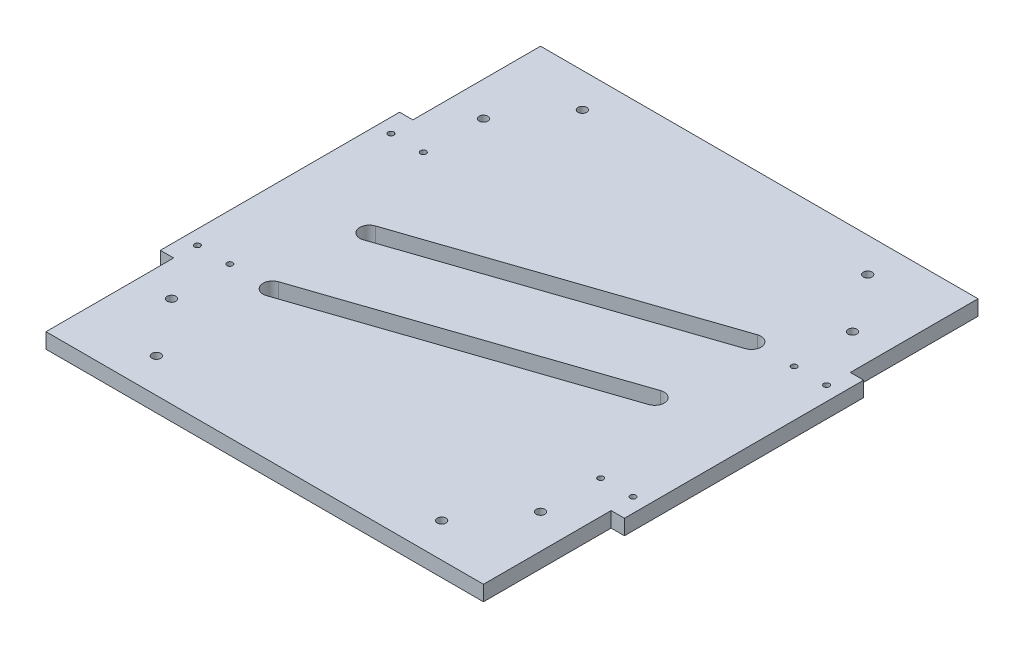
ISO-10303-21;
HEADER;
FILE_DESCRIPTION(('STEP AP214'),'2;1');
FILE_NAME('part.step','',(''),(''),'','','');
FILE_SCHEMA(('AUTOMOTIVE_DESIGN { 1 0 10303 214 1 1 1 1 }'));
ENDSEC;
DATA;
#1=APPLICATION_CONTEXT('core data for automotive mechanical design processes');
#2=APPLICATION_PROTOCOL_DEFINITION('international standard','automotive_design',2000,#1);
#3=PRODUCT_CONTEXT('',#1,'mechanical');
#4=PRODUCT('Part','Part','',(#3));
#5=PRODUCT_RELATED_PRODUCT_CATEGORY('part','',(#4));
#6=PRODUCT_DEFINITION_FORMATION('','',#4);
#7=PRODUCT_DEFINITION_CONTEXT('part definition',#1,'design');
#8=PRODUCT_DEFINITION('design','',#6,#7);
#9=PRODUCT_DEFINITION_SHAPE('','',#8);
#10=(LENGTH_UNIT() NAMED_UNIT(*) SI_UNIT(.MILLI.,.METRE.));
#11=(NAMED_UNIT(*) PLANE_ANGLE_UNIT() SI_UNIT($,.RADIAN.));
#12=(NAMED_UNIT(*) SI_UNIT($,.STERADIAN.) SOLID_ANGLE_UNIT());
#13=UNCERTAINTY_MEASURE_WITH_UNIT(LENGTH_MEASURE(1.E-05),#10,'distance_accuracy_value','');
#14=(GEOMETRIC_REPRESENTATION_CONTEXT(3) GLOBAL_UNCERTAINTY_ASSIGNED_CONTEXT((#13)) GLOBAL_UNIT_ASSIGNED_CONTEXT((#10,
#11,#12)) REPRESENTATION_CONTEXT('',''));
#15=CARTESIAN_POINT('',(0.,0.,0.));
#16=DIRECTION('',(0.,0.,1.));
#17=DIRECTION('',(1.,0.,0.));
#18=AXIS2_PLACEMENT_3D('',#15,#16,#17);
#19=CARTESIAN_POINT('',(0.,8.,0.));
#20=DIRECTION('',(0.,-1.,0.));
#21=DIRECTION('',(0.,0.,-1.));
#22=AXIS2_PLACEMENT_3D('',#19,#20,#21);
#23=PLANE('',#22);
#24=CARTESIAN_POINT('',(-75.,8.,0.));
#25=DIRECTION('',(0.,1.,0.));
#26=DIRECTION('',(0.,0.,1.));
#27=AXIS2_PLACEMENT_3D('',#24,#25,#26);
#28=CIRCLE('',#27,5.);
#29=CARTESIAN_POINT('',(-76.6059762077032,8.,-4.73506498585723));
#30=VERTEX_POINT('',#29);
#31=CARTESIAN_POINT('',(-73.3940237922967,8.,4.73506498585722));
#32=VERTEX_POINT('',#31);
#33=EDGE_CURVE('E212',#30,#32,#28,.T.);
#34=ORIENTED_EDGE('',*,*,#33,.F.);
#35=DIRECTION('',(-0.947012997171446,0.,0.321195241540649));
#36=VECTOR('',#35,1.);
#37=CARTESIAN_POINT('',(-76.6059762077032,8.,-4.73506498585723));
#38=LINE('',#37,#36);
#39=CARTESIAN_POINT('',(73.3940237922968,8.,-55.6100649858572));
#40=VERTEX_POINT('',#39);
#41=EDGE_CURVE('E220',#40,#30,#38,.T.);
#42=ORIENTED_EDGE('',*,*,#41,.F.);
#43=CARTESIAN_POINT('',(75.,8.,-50.875));
#44=DIRECTION('',(0.,1.,0.));
#45=DIRECTION('',(0.,0.,1.));
#46=AXIS2_PLACEMENT_3D('',#43,#44,#45);
#47=CIRCLE('',#46,5.00000000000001);
#48=CARTESIAN_POINT('',(76.6059762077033,8.,-46.1399350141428));
#49=VERTEX_POINT('',#48);
#50=EDGE_CURVE('E217',#49,#40,#47,.T.);
#51=ORIENTED_EDGE('',*,*,#50,.F.);
#52=DIRECTION('',(0.947012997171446,0.,-0.321195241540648));
#53=VECTOR('',#52,1.);
#54=CARTESIAN_POINT('',(-73.3940237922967,8.,4.73506498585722));
#55=LINE('',#54,#53);
#56=EDGE_CURVE('E214',#32,#49,#55,.T.);
#57=ORIENTED_EDGE('',*,*,#56,.F.);
#58=EDGE_LOOP('',(#34,#42,#51,#57));
#59=FACE_BOUND('',#58,.T.);
#60=DIRECTION('',(0.,0.,1.));
#61=VECTOR('',#60,1.);
#62=CARTESIAN_POINT('',(-115.,8.,-62.88));
#63=LINE('',#62,#61);
#64=CARTESIAN_POINT('',(-115.,8.,-130.));
#65=VERTEX_POINT('',#64);
#66=CARTESIAN_POINT('',(-115.,8.,-62.88));
#67=VERTEX_POINT('',#66);
#68=EDGE_CURVE('E339',#65,#67,#63,.T.);
#69=ORIENTED_EDGE('',*,*,#68,.T.);
#70=DIRECTION('',(-1.,0.,0.));
#71=VECTOR('',#70,1.);
#72=CARTESIAN_POINT('',(-122.,8.,-62.88));
#73=LINE('',#72,#71);
#74=CARTESIAN_POINT('',(-122.,8.,-62.88));
#75=VERTEX_POINT('',#74);
#76=EDGE_CURVE('E342',#67,#75,#73,.T.);
#77=ORIENTED_EDGE('',*,*,#76,.T.);
#78=DIRECTION('',(0.,0.,1.));
#79=VECTOR('',#78,1.);
#80=CARTESIAN_POINT('',(-122.,8.,62.88));
#81=LINE('',#80,#79);
#82=CARTESIAN_POINT('',(-122.,8.,62.88));
#83=VERTEX_POINT('',#82);
#84=EDGE_CURVE('E345',#75,#83,#81,.T.);
#85=ORIENTED_EDGE('',*,*,#84,.T.);
#86=DIRECTION('',(1.,0.,0.));
#87=VECTOR('',#86,1.);
#88=CARTESIAN_POINT('',(-115.,8.,62.88));
#89=LINE('',#88,#87);
#90=CARTESIAN_POINT('',(-115.,8.,62.88));
#91=VERTEX_POINT('',#90);
#92=EDGE_CURVE('E347',#83,#91,#89,.T.);
#93=ORIENTED_EDGE('',*,*,#92,.T.);
#94=DIRECTION('',(0.,0.,1.));
#95=VECTOR('',#94,1.);
#96=CARTESIAN_POINT('',(-115.,8.,130.));
#97=LINE('',#96,#95);
#98=CARTESIAN_POINT('',(-115.,8.,130.));
#99=VERTEX_POINT('',#98);
#100=EDGE_CURVE('E349',#91,#99,#97,.T.);
#101=ORIENTED_EDGE('',*,*,#100,.T.);
#102=DIRECTION('',(1.,0.,0.));
#103=VECTOR('',#102,1.);
#104=CARTESIAN_POINT('',(115.,8.,130.));
#105=LINE('',#104,#103);
#106=CARTESIAN_POINT('',(115.,8.,130.));
#107=VERTEX_POINT('',#106);
#108=EDGE_CURVE('E351',#99,#107,#105,.T.);
#109=ORIENTED_EDGE('',*,*,#108,.T.);
#110=DIRECTION('',(0.,0.,-1.));
#111=VECTOR('',#110,1.);
#112=CARTESIAN_POINT('',(115.,8.,62.88));
#113=LINE('',#112,#111);
#114=CARTESIAN_POINT('',(115.,8.,62.88));
#115=VERTEX_POINT('',#114);
#116=EDGE_CURVE('E353',#107,#115,#113,.T.);
#117=ORIENTED_EDGE('',*,*,#116,.T.);
#118=DIRECTION('',(1.,0.,0.));
#119=VECTOR('',#118,1.);
#120=CARTESIAN_POINT('',(122.,8.,62.88));
#121=LINE('',#120,#119);
#122=CARTESIAN_POINT('',(122.,8.,62.88));
#123=VERTEX_POINT('',#122);
#124=EDGE_CURVE('E355',#115,#123,#121,.T.);
#125=ORIENTED_EDGE('',*,*,#124,.T.);
#126=DIRECTION('',(0.,0.,-1.));
#127=VECTOR('',#126,1.);
#128=CARTESIAN_POINT('',(122.,8.,-62.88));
#129=LINE('',#128,#127);
#130=CARTESIAN_POINT('',(122.,8.,-62.88));
#131=VERTEX_POINT('',#130);
#132=EDGE_CURVE('E357',#123,#131,#129,.T.);
#133=ORIENTED_EDGE('',*,*,#132,.T.);
#134=DIRECTION('',(-1.,0.,0.));
#135=VECTOR('',#134,1.);
#136=CARTESIAN_POINT('',(115.,8.,-62.88));
#137=LINE('',#136,#135);
#138=CARTESIAN_POINT('',(115.,8.,-62.88));
#139=VERTEX_POINT('',#138);
#140=EDGE_CURVE('E359',#131,#139,#137,.T.);
#141=ORIENTED_EDGE('',*,*,#140,.T.);
#142=DIRECTION('',(0.,0.,-1.));
#143=VECTOR('',#142,1.);
#144=CARTESIAN_POINT('',(115.,8.,-130.));
#145=LINE('',#144,#143);
#146=CARTESIAN_POINT('',(115.,8.,-130.));
#147=VERTEX_POINT('',#146);
#148=EDGE_CURVE('E361',#139,#147,#145,.T.);
#149=ORIENTED_EDGE('',*,*,#148,.T.);
#150=DIRECTION('',(-1.,0.,0.));
#151=VECTOR('',#150,1.);
#152=CARTESIAN_POINT('',(-115.,8.,-130.));
#153=LINE('',#152,#151);
#154=EDGE_CURVE('E363',#147,#65,#153,.T.);
#155=ORIENTED_EDGE('',*,*,#154,.T.);
#156=EDGE_LOOP('',(#69,#77,#85,#93,#101,#109,#117,#125,#133,#141,#149,#155));
#157=FACE_BOUND('',#156,.T.);
#158=CARTESIAN_POINT('',(-75.,8.,112.));
#159=DIRECTION('',(0.,1.,0.));
#160=DIRECTION('',(0.,0.,1.));
#161=AXIS2_PLACEMENT_3D('',#158,#159,#160);
#162=CIRCLE('',#161,2.28499999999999);
#163=CARTESIAN_POINT('',(-75.,8.,114.285));
#164=VERTEX_POINT('',#163);
#165=EDGE_CURVE('E333',#164,#164,#162,.T.);
#166=ORIENTED_EDGE('',*,*,#165,.F.);
#167=EDGE_LOOP('',(#166));
#168=FACE_BOUND('',#167,.T.);
#169=CARTESIAN_POINT('',(-97.,8.,82.));
#170=DIRECTION('',(0.,1.,0.));
#171=DIRECTION('',(0.,0.,1.));
#172=AXIS2_PLACEMENT_3D('',#169,#170,#171);
#173=CIRCLE('',#172,2.28499999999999);
#174=CARTESIAN_POINT('',(-97.,8.,84.285));
#175=VERTEX_POINT('',#174);
#176=EDGE_CURVE('E327',#175,#175,#173,.T.);
#177=ORIENTED_EDGE('',*,*,#176,.F.);
#178=EDGE_LOOP('',(#177));
#179=FACE_BOUND('',#178,.T.);
#180=CARTESIAN_POINT('',(97.,8.,82.));
#181=DIRECTION('',(0.,1.,0.));
#182=DIRECTION('',(0.,0.,-1.));
#183=AXIS2_PLACEMENT_3D('',#180,#181,#182);
#184=CIRCLE('',#183,2.28499999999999);
#185=CARTESIAN_POINT('',(97.,8.,79.715));
#186=VERTEX_POINT('',#185);
#187=EDGE_CURVE('E321',#186,#186,#184,.T.);
#188=ORIENTED_EDGE('',*,*,#187,.F.);
#189=EDGE_LOOP('',(#188));
#190=FACE_BOUND('',#189,.T.);
#191=CARTESIAN_POINT('',(75.,8.,112.));
#192=DIRECTION('',(0.,1.,0.));
#193=DIRECTION('',(0.,0.,-1.));
#194=AXIS2_PLACEMENT_3D('',#191,#192,#193);
#195=CIRCLE('',#194,2.28499999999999);
#196=CARTESIAN_POINT('',(75.,8.,109.715));
#197=VERTEX_POINT('',#196);
#198=EDGE_CURVE('E315',#197,#197,#195,.T.);
#199=ORIENTED_EDGE('',*,*,#198,.F.);
#200=EDGE_LOOP('',(#199));
#201=FACE_BOUND('',#200,.T.);
#202=CARTESIAN_POINT('',(75.,8.,-112.));
#203=DIRECTION('',(0.,1.,0.));
#204=DIRECTION('',(0.,0.,1.));
#205=AXIS2_PLACEMENT_3D('',#202,#203,#204);
#206=CIRCLE('',#205,2.28499999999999);
#207=CARTESIAN_POINT('',(75.,8.,-109.715));
#208=VERTEX_POINT('',#207);
#209=EDGE_CURVE('E309',#208,#208,#206,.T.);
#210=ORIENTED_EDGE('',*,*,#209,.F.);
#211=EDGE_LOOP('',(#210));
#212=FACE_BOUND('',#211,.T.);
#213=CARTESIAN_POINT('',(97.,8.,-82.));
#214=DIRECTION('',(0.,1.,0.));
#215=DIRECTION('',(0.,0.,1.));
#216=AXIS2_PLACEMENT_3D('',#213,#214,#215);
#217=CIRCLE('',#216,2.28499999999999);
#218=CARTESIAN_POINT('',(97.,8.,-79.715));
#219=VERTEX_POINT('',#218);
#220=EDGE_CURVE('E303',#219,#219,#217,.T.);
#221=ORIENTED_EDGE('',*,*,#220,.F.);
#222=EDGE_LOOP('',(#221));
#223=FACE_BOUND('',#222,.T.);
#224=CARTESIAN_POINT('',(-97.,8.,-82.));
#225=DIRECTION('',(0.,1.,0.));
#226=DIRECTION('',(0.,0.,-1.));
#227=AXIS2_PLACEMENT_3D('',#224,#225,#226);
#228=CIRCLE('',#227,2.28499999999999);
#229=CARTESIAN_POINT('',(-97.,8.,-84.285));
#230=VERTEX_POINT('',#229);
#231=EDGE_CURVE('E297',#230,#230,#228,.T.);
#232=ORIENTED_EDGE('',*,*,#231,.F.);
#233=EDGE_LOOP('',(#232));
#234=FACE_BOUND('',#233,.T.);
#235=CARTESIAN_POINT('',(-75.,8.,-112.));
#236=DIRECTION('',(0.,1.,0.));
#237=DIRECTION('',(0.,0.,-1.));
#238=AXIS2_PLACEMENT_3D('',#235,#236,#237);
#239=CIRCLE('',#238,2.28499999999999);
#240=CARTESIAN_POINT('',(-75.,8.,-114.285));
#241=VERTEX_POINT('',#240);
#242=EDGE_CURVE('E291',#241,#241,#239,.T.);
#243=ORIENTED_EDGE('',*,*,#242,.F.);
#244=EDGE_LOOP('',(#243));
#245=FACE_BOUND('',#244,.T.);
#246=CARTESIAN_POINT('',(-97.5,8.,-50.875));
#247=DIRECTION('',(0.,1.,0.));
#248=DIRECTION('',(0.,0.,1.));
#249=AXIS2_PLACEMENT_3D('',#246,#247,#248);
#250=CIRCLE('',#249,1.5);
#251=CARTESIAN_POINT('',(-97.5,8.,-49.375));
#252=VERTEX_POINT('',#251);
#253=EDGE_CURVE('E285',#252,#252,#250,.T.);
#254=ORIENTED_EDGE('',*,*,#253,.F.);
#255=EDGE_LOOP('',(#254));
#256=FACE_BOUND('',#255,.T.);
#257=CARTESIAN_POINT('',(-114.5,8.,50.875));
#258=DIRECTION('',(0.,1.,0.));
#259=DIRECTION('',(0.,0.,1.));
#260=AXIS2_PLACEMENT_3D('',#257,#258,#259);
#261=CIRCLE('',#260,1.5);
#262=CARTESIAN_POINT('',(-114.5,8.,52.375));
#263=VERTEX_POINT('',#262);
#264=EDGE_CURVE('E279',#263,#263,#261,.T.);
#265=ORIENTED_EDGE('',*,*,#264,.F.);
#266=EDGE_LOOP('',(#265));
#267=FACE_BOUND('',#266,.T.);
#268=CARTESIAN_POINT('',(-114.5,8.,-50.875));
#269=DIRECTION('',(0.,1.,0.));
#270=DIRECTION('',(0.,0.,1.));
#271=AXIS2_PLACEMENT_3D('',#268,#269,#270);
#272=CIRCLE('',#271,1.5);
#273=CARTESIAN_POINT('',(-114.5,8.,-49.375));
#274=VERTEX_POINT('',#273);
#275=EDGE_CURVE('E273',#274,#274,#272,.T.);
#276=ORIENTED_EDGE('',*,*,#275,.F.);
#277=EDGE_LOOP('',(#276));
#278=FACE_BOUND('',#277,.T.);
#279=CARTESIAN_POINT('',(-97.5,8.,50.875));
#280=DIRECTION('',(0.,1.,0.));
#281=DIRECTION('',(0.,0.,1.));
#282=AXIS2_PLACEMENT_3D('',#279,#280,#281);
#283=CIRCLE('',#282,1.5);
#284=CARTESIAN_POINT('',(-97.5,8.,52.375));
#285=VERTEX_POINT('',#284);
#286=EDGE_CURVE('E267',#285,#285,#283,.T.);
#287=ORIENTED_EDGE('',*,*,#286,.F.);
#288=EDGE_LOOP('',(#287));
#289=FACE_BOUND('',#288,.T.);
#290=CARTESIAN_POINT('',(97.5,8.,50.875));
#291=DIRECTION('',(0.,1.,0.));
#292=DIRECTION('',(0.,0.,-1.));
#293=AXIS2_PLACEMENT_3D('',#290,#291,#292);
#294=CIRCLE('',#293,1.5);
#295=CARTESIAN_POINT('',(97.5,8.,49.375));
#296=VERTEX_POINT('',#295);
#297=EDGE_CURVE('E261',#296,#296,#294,.T.);
#298=ORIENTED_EDGE('',*,*,#297,.F.);
#299=EDGE_LOOP('',(#298));
#300=FACE_BOUND('',#299,.T.);
#301=CARTESIAN_POINT('',(114.5,8.,50.875));
#302=DIRECTION('',(0.,1.,0.));
#303=DIRECTION('',(0.,0.,-1.));
#304=AXIS2_PLACEMENT_3D('',#301,#302,#303);
#305=CIRCLE('',#304,1.5);
#306=CARTESIAN_POINT('',(114.5,8.,49.375));
#307=VERTEX_POINT('',#306);
#308=EDGE_CURVE('E255',#307,#307,#305,.T.);
#309=ORIENTED_EDGE('',*,*,#308,.F.);
#310=EDGE_LOOP('',(#309));
#311=FACE_BOUND('',#310,.T.);
#312=CARTESIAN_POINT('',(97.5,8.,-50.875));
#313=DIRECTION('',(0.,1.,0.));
#314=DIRECTION('',(0.,0.,-1.));
#315=AXIS2_PLACEMENT_3D('',#312,#313,#314);
#316=CIRCLE('',#315,1.5);
#317=CARTESIAN_POINT('',(97.5,8.,-52.375));
#318=VERTEX_POINT('',#317);
#319=EDGE_CURVE('E249',#318,#318,#316,.T.);
#320=ORIENTED_EDGE('',*,*,#319,.F.);
#321=EDGE_LOOP('',(#320));
#322=FACE_BOUND('',#321,.T.);
#323=CARTESIAN_POINT('',(114.5,8.,-50.875));
#324=DIRECTION('',(0.,1.,0.));
#325=DIRECTION('',(0.,0.,-1.));
#326=AXIS2_PLACEMENT_3D('',#323,#324,#325);
#327=CIRCLE('',#326,1.5);
#328=CARTESIAN_POINT('',(114.5,8.,-52.375));
#329=VERTEX_POINT('',#328);
#330=EDGE_CURVE('E243',#329,#329,#327,.T.);
#331=ORIENTED_EDGE('',*,*,#330,.F.);
#332=EDGE_LOOP('',(#331));
#333=FACE_BOUND('',#332,.T.);
#334=CARTESIAN_POINT('',(-75.,8.,50.875));
#335=DIRECTION('',(0.,1.,0.));
#336=DIRECTION('',(0.,0.,1.));
#337=AXIS2_PLACEMENT_3D('',#334,#335,#336);
#338=CIRCLE('',#337,4.99999999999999);
#339=CARTESIAN_POINT('',(-76.6059762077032,8.,46.1399350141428));
#340=VERTEX_POINT('',#339);
#341=CARTESIAN_POINT('',(-73.3940237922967,8.,55.6100649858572));
#342=VERTEX_POINT('',#341);
#343=EDGE_CURVE('E176',#340,#342,#338,.T.);
#344=ORIENTED_EDGE('',*,*,#343,.F.);
#345=DIRECTION('',(-0.947012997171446,0.,0.321195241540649));
#346=VECTOR('',#345,1.);
#347=CARTESIAN_POINT('',(-76.6059762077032,8.,46.1399350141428));
#348=LINE('',#347,#346);
#349=CARTESIAN_POINT('',(73.3940237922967,8.,-4.73506498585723));
#350=VERTEX_POINT('',#349);
#351=EDGE_CURVE('E198',#350,#340,#348,.T.);
#352=ORIENTED_EDGE('',*,*,#351,.F.);
#353=CARTESIAN_POINT('',(75.,8.,0.));
#354=DIRECTION('',(0.,1.,0.));
#355=DIRECTION('',(0.,0.,1.));
#356=AXIS2_PLACEMENT_3D('',#353,#354,#355);
#357=CIRCLE('',#356,5.);
#358=CARTESIAN_POINT('',(76.6059762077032,8.,4.73506498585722));
#359=VERTEX_POINT('',#358);
#360=EDGE_CURVE('E196',#359,#350,#357,.T.);
#361=ORIENTED_EDGE('',*,*,#360,.F.);
#362=DIRECTION('',(0.947012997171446,0.,-0.321195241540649));
#363=VECTOR('',#362,1.);
#364=CARTESIAN_POINT('',(-73.3940237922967,8.,55.6100649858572));
#365=LINE('',#364,#363);
#366=EDGE_CURVE('E184',#342,#359,#365,.T.);
#367=ORIENTED_EDGE('',*,*,#366,.F.);
#368=EDGE_LOOP('',(#344,#352,#361,#367));
#369=FACE_BOUND('',#368,.T.);
#370=ADVANCED_FACE('F39',(#59,#157,#168,#179,#190,#201,#212,#223,#234,#245,#256,#267,#278,#289,
#300,#311,#322,#333,#369),#23,.F.);
#371=CARTESIAN_POINT('',(0.,0.,0.));
#372=DIRECTION('',(0.,-1.,0.));
#373=DIRECTION('',(0.,0.,-1.));
#374=AXIS2_PLACEMENT_3D('',#371,#372,#373);
#375=PLANE('',#374);
#376=CARTESIAN_POINT('',(97.5,0.,-50.875));
#377=DIRECTION('',(0.,1.,0.));
#378=DIRECTION('',(0.,0.,-1.));
#379=AXIS2_PLACEMENT_3D('',#376,#377,#378);
#380=CIRCLE('',#379,1.5);
#381=CARTESIAN_POINT('',(97.5,0.,-52.375));
#382=VERTEX_POINT('',#381);
#383=EDGE_CURVE('E246',#382,#382,#380,.T.);
#384=ORIENTED_EDGE('',*,*,#383,.T.);
#385=EDGE_LOOP('',(#384));
#386=FACE_BOUND('',#385,.T.);
#387=CARTESIAN_POINT('',(97.5,0.,50.875));
#388=DIRECTION('',(0.,1.,0.));
#389=DIRECTION('',(0.,0.,-1.));
#390=AXIS2_PLACEMENT_3D('',#387,#388,#389);
#391=CIRCLE('',#390,1.5);
#392=CARTESIAN_POINT('',(97.5,0.,49.375));
#393=VERTEX_POINT('',#392);
#394=EDGE_CURVE('E258',#393,#393,#391,.T.);
#395=ORIENTED_EDGE('',*,*,#394,.T.);
#396=EDGE_LOOP('',(#395));
#397=FACE_BOUND('',#396,.T.);
#398=CARTESIAN_POINT('',(-114.5,0.,-50.875));
#399=DIRECTION('',(0.,1.,0.));
#400=DIRECTION('',(0.,0.,1.));
#401=AXIS2_PLACEMENT_3D('',#398,#399,#400);
#402=CIRCLE('',#401,1.5);
#403=CARTESIAN_POINT('',(-114.5,0.,-49.375));
#404=VERTEX_POINT('',#403);
#405=EDGE_CURVE('E270',#404,#404,#402,.T.);
#406=ORIENTED_EDGE('',*,*,#405,.T.);
#407=EDGE_LOOP('',(#406));
#408=FACE_BOUND('',#407,.T.);
#409=CARTESIAN_POINT('',(-97.5,0.,-50.875));
#410=DIRECTION('',(0.,1.,0.));
#411=DIRECTION('',(0.,0.,1.));
#412=AXIS2_PLACEMENT_3D('',#409,#410,#411);
#413=CIRCLE('',#412,1.5);
#414=CARTESIAN_POINT('',(-97.5,0.,-49.375));
#415=VERTEX_POINT('',#414);
#416=EDGE_CURVE('E282',#415,#415,#413,.T.);
#417=ORIENTED_EDGE('',*,*,#416,.T.);
#418=EDGE_LOOP('',(#417));
#419=FACE_BOUND('',#418,.T.);
#420=CARTESIAN_POINT('',(-97.,0.,-82.));
#421=DIRECTION('',(0.,1.,0.));
#422=DIRECTION('',(0.,0.,-1.));
#423=AXIS2_PLACEMENT_3D('',#420,#421,#422);
#424=CIRCLE('',#423,2.28499999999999);
#425=CARTESIAN_POINT('',(-97.,0.,-84.285));
#426=VERTEX_POINT('',#425);
#427=EDGE_CURVE('E294',#426,#426,#424,.T.);
#428=ORIENTED_EDGE('',*,*,#427,.T.);
#429=EDGE_LOOP('',(#428));
#430=FACE_BOUND('',#429,.T.);
#431=CARTESIAN_POINT('',(75.,0.,-112.));
#432=DIRECTION('',(0.,1.,0.));
#433=DIRECTION('',(0.,0.,1.));
#434=AXIS2_PLACEMENT_3D('',#431,#432,#433);
#435=CIRCLE('',#434,2.28499999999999);
#436=CARTESIAN_POINT('',(75.,0.,-109.715));
#437=VERTEX_POINT('',#436);
#438=EDGE_CURVE('E306',#437,#437,#435,.T.);
#439=ORIENTED_EDGE('',*,*,#438,.T.);
#440=EDGE_LOOP('',(#439));
#441=FACE_BOUND('',#440,.T.);
#442=CARTESIAN_POINT('',(97.,0.,82.));
#443=DIRECTION('',(0.,1.,0.));
#444=DIRECTION('',(0.,0.,-1.));
#445=AXIS2_PLACEMENT_3D('',#442,#443,#444);
#446=CIRCLE('',#445,2.28499999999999);
#447=CARTESIAN_POINT('',(97.,0.,79.715));
#448=VERTEX_POINT('',#447);
#449=EDGE_CURVE('E318',#448,#448,#446,.T.);
#450=ORIENTED_EDGE('',*,*,#449,.T.);
#451=EDGE_LOOP('',(#450));
#452=FACE_BOUND('',#451,.T.);
#453=CARTESIAN_POINT('',(-75.,0.,112.));
#454=DIRECTION('',(0.,1.,0.));
#455=DIRECTION('',(0.,0.,1.));
#456=AXIS2_PLACEMENT_3D('',#453,#454,#455);
#457=CIRCLE('',#456,2.28499999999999);
#458=CARTESIAN_POINT('',(-75.,0.,114.285));
#459=VERTEX_POINT('',#458);
#460=EDGE_CURVE('E330',#459,#459,#457,.T.);
#461=ORIENTED_EDGE('',*,*,#460,.T.);
#462=EDGE_LOOP('',(#461));
#463=FACE_BOUND('',#462,.T.);
#464=DIRECTION('',(0.,0.,1.));
#465=VECTOR('',#464,1.);
#466=CARTESIAN_POINT('',(-115.,0.,-62.88));
#467=LINE('',#466,#465);
#468=CARTESIAN_POINT('',(-115.,0.,-130.));
#469=VERTEX_POINT('',#468);
#470=CARTESIAN_POINT('',(-115.,0.,-62.88));
#471=VERTEX_POINT('',#470);
#472=EDGE_CURVE('E336',#469,#471,#467,.T.);
#473=ORIENTED_EDGE('',*,*,#472,.F.);
#474=DIRECTION('',(-1.,0.,0.));
#475=VECTOR('',#474,1.);
#476=CARTESIAN_POINT('',(-115.,0.,-130.));
#477=LINE('',#476,#475);
#478=CARTESIAN_POINT('',(115.,0.,-130.));
#479=VERTEX_POINT('',#478);
#480=EDGE_CURVE('E343',#479,#469,#477,.T.);
#481=ORIENTED_EDGE('',*,*,#480,.F.);
#482=DIRECTION('',(0.,0.,-1.));
#483=VECTOR('',#482,1.);
#484=CARTESIAN_POINT('',(115.,0.,-130.));
#485=LINE('',#484,#483);
#486=CARTESIAN_POINT('',(115.,0.,-62.88));
#487=VERTEX_POINT('',#486);
#488=EDGE_CURVE('E386',#487,#479,#485,.T.);
#489=ORIENTED_EDGE('',*,*,#488,.F.);
#490=DIRECTION('',(-1.,0.,0.));
#491=VECTOR('',#490,1.);
#492=CARTESIAN_POINT('',(115.,0.,-62.88));
#493=LINE('',#492,#491);
#494=CARTESIAN_POINT('',(122.,0.,-62.88));
#495=VERTEX_POINT('',#494);
#496=EDGE_CURVE('E384',#495,#487,#493,.T.);
#497=ORIENTED_EDGE('',*,*,#496,.F.);
#498=DIRECTION('',(0.,0.,-1.));
#499=VECTOR('',#498,1.);
#500=CARTESIAN_POINT('',(122.,0.,-62.88));
#501=LINE('',#500,#499);
#502=CARTESIAN_POINT('',(122.,0.,62.88));
#503=VERTEX_POINT('',#502);
#504=EDGE_CURVE('E382',#503,#495,#501,.T.);
#505=ORIENTED_EDGE('',*,*,#504,.F.);
#506=DIRECTION('',(1.,0.,0.));
#507=VECTOR('',#506,1.);
#508=CARTESIAN_POINT('',(122.,0.,62.88));
#509=LINE('',#508,#507);
#510=CARTESIAN_POINT('',(115.,0.,62.88));
#511=VERTEX_POINT('',#510);
#512=EDGE_CURVE('E380',#511,#503,#509,.T.);
#513=ORIENTED_EDGE('',*,*,#512,.F.);
#514=DIRECTION('',(0.,0.,-1.));
#515=VECTOR('',#514,1.);
#516=CARTESIAN_POINT('',(115.,0.,62.88));
#517=LINE('',#516,#515);
#518=CARTESIAN_POINT('',(115.,0.,130.));
#519=VERTEX_POINT('',#518);
#520=EDGE_CURVE('E378',#519,#511,#517,.T.);
#521=ORIENTED_EDGE('',*,*,#520,.F.);
#522=DIRECTION('',(1.,0.,0.));
#523=VECTOR('',#522,1.);
#524=CARTESIAN_POINT('',(115.,0.,130.));
#525=LINE('',#524,#523);
#526=CARTESIAN_POINT('',(-115.,0.,130.));
#527=VERTEX_POINT('',#526);
#528=EDGE_CURVE('E376',#527,#519,#525,.T.);
#529=ORIENTED_EDGE('',*,*,#528,.F.);
#530=DIRECTION('',(0.,0.,1.));
#531=VECTOR('',#530,1.);
#532=CARTESIAN_POINT('',(-115.,0.,130.));
#533=LINE('',#532,#531);
#534=CARTESIAN_POINT('',(-115.,0.,62.88));
#535=VERTEX_POINT('',#534);
#536=EDGE_CURVE('E374',#535,#527,#533,.T.);
#537=ORIENTED_EDGE('',*,*,#536,.F.);
#538=DIRECTION('',(1.,0.,0.));
#539=VECTOR('',#538,1.);
#540=CARTESIAN_POINT('',(-115.,0.,62.88));
#541=LINE('',#540,#539);
#542=CARTESIAN_POINT('',(-122.,0.,62.88));
#543=VERTEX_POINT('',#542);
#544=EDGE_CURVE('E372',#543,#535,#541,.T.);
#545=ORIENTED_EDGE('',*,*,#544,.F.);
#546=DIRECTION('',(0.,0.,1.));
#547=VECTOR('',#546,1.);
#548=CARTESIAN_POINT('',(-122.,0.,62.88));
#549=LINE('',#548,#547);
#550=CARTESIAN_POINT('',(-122.,0.,-62.88));
#551=VERTEX_POINT('',#550);
#552=EDGE_CURVE('E370',#551,#543,#549,.T.);
#553=ORIENTED_EDGE('',*,*,#552,.F.);
#554=DIRECTION('',(-1.,0.,0.));
#555=VECTOR('',#554,1.);
#556=CARTESIAN_POINT('',(-122.,0.,-62.88));
#557=LINE('',#556,#555);
#558=EDGE_CURVE('E368',#471,#551,#557,.T.);
#559=ORIENTED_EDGE('',*,*,#558,.F.);
#560=EDGE_LOOP('',(#473,#481,#489,#497,#505,#513,#521,#529,#537,#545,#553,#559));
#561=FACE_BOUND('',#560,.T.);
#562=CARTESIAN_POINT('',(-97.,0.,82.));
#563=DIRECTION('',(0.,1.,0.));
#564=DIRECTION('',(0.,0.,1.));
#565=AXIS2_PLACEMENT_3D('',#562,#563,#564);
#566=CIRCLE('',#565,2.28499999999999);
#567=CARTESIAN_POINT('',(-97.,0.,84.285));
#568=VERTEX_POINT('',#567);
#569=EDGE_CURVE('E324',#568,#568,#566,.T.);
#570=ORIENTED_EDGE('',*,*,#569,.T.);
#571=EDGE_LOOP('',(#570));
#572=FACE_BOUND('',#571,.T.);
#573=CARTESIAN_POINT('',(75.,0.,112.));
#574=DIRECTION('',(0.,1.,0.));
#575=DIRECTION('',(0.,0.,-1.));
#576=AXIS2_PLACEMENT_3D('',#573,#574,#575);
#577=CIRCLE('',#576,2.28499999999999);
#578=CARTESIAN_POINT('',(75.,0.,109.715));
#579=VERTEX_POINT('',#578);
#580=EDGE_CURVE('E312',#579,#579,#577,.T.);
#581=ORIENTED_EDGE('',*,*,#580,.T.);
#582=EDGE_LOOP('',(#581));
#583=FACE_BOUND('',#582,.T.);
#584=CARTESIAN_POINT('',(97.,0.,-82.));
#585=DIRECTION('',(0.,1.,0.));
#586=DIRECTION('',(0.,0.,1.));
#587=AXIS2_PLACEMENT_3D('',#584,#585,#586);
#588=CIRCLE('',#587,2.28499999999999);
#589=CARTESIAN_POINT('',(97.,0.,-79.715));
#590=VERTEX_POINT('',#589);
#591=EDGE_CURVE('E300',#590,#590,#588,.T.);
#592=ORIENTED_EDGE('',*,*,#591,.T.);
#593=EDGE_LOOP('',(#592));
#594=FACE_BOUND('',#593,.T.);
#595=CARTESIAN_POINT('',(-75.,0.,-112.));
#596=DIRECTION('',(0.,1.,0.));
#597=DIRECTION('',(0.,0.,-1.));
#598=AXIS2_PLACEMENT_3D('',#595,#596,#597);
#599=CIRCLE('',#598,2.28499999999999);
#600=CARTESIAN_POINT('',(-75.,0.,-114.285));
#601=VERTEX_POINT('',#600);
#602=EDGE_CURVE('E288',#601,#601,#599,.T.);
#603=ORIENTED_EDGE('',*,*,#602,.T.);
#604=EDGE_LOOP('',(#603));
#605=FACE_BOUND('',#604,.T.);
#606=CARTESIAN_POINT('',(-114.5,0.,50.875));
#607=DIRECTION('',(0.,1.,0.));
#608=DIRECTION('',(0.,0.,1.));
#609=AXIS2_PLACEMENT_3D('',#606,#607,#608);
#610=CIRCLE('',#609,1.5);
#611=CARTESIAN_POINT('',(-114.5,0.,52.375));
#612=VERTEX_POINT('',#611);
#613=EDGE_CURVE('E276',#612,#612,#610,.T.);
#614=ORIENTED_EDGE('',*,*,#613,.T.);
#615=EDGE_LOOP('',(#614));
#616=FACE_BOUND('',#615,.T.);
#617=CARTESIAN_POINT('',(-97.5,0.,50.875));
#618=DIRECTION('',(0.,1.,0.));
#619=DIRECTION('',(0.,0.,1.));
#620=AXIS2_PLACEMENT_3D('',#617,#618,#619);
#621=CIRCLE('',#620,1.5);
#622=CARTESIAN_POINT('',(-97.5,0.,52.375));
#623=VERTEX_POINT('',#622);
#624=EDGE_CURVE('E264',#623,#623,#621,.T.);
#625=ORIENTED_EDGE('',*,*,#624,.T.);
#626=EDGE_LOOP('',(#625));
#627=FACE_BOUND('',#626,.T.);
#628=CARTESIAN_POINT('',(114.5,0.,50.875));
#629=DIRECTION('',(0.,1.,0.));
#630=DIRECTION('',(0.,0.,-1.));
#631=AXIS2_PLACEMENT_3D('',#628,#629,#630);
#632=CIRCLE('',#631,1.5);
#633=CARTESIAN_POINT('',(114.5,0.,49.375));
#634=VERTEX_POINT('',#633);
#635=EDGE_CURVE('E252',#634,#634,#632,.T.);
#636=ORIENTED_EDGE('',*,*,#635,.T.);
#637=EDGE_LOOP('',(#636));
#638=FACE_BOUND('',#637,.T.);
#639=CARTESIAN_POINT('',(114.5,0.,-50.875));
#640=DIRECTION('',(0.,1.,0.));
#641=DIRECTION('',(0.,0.,-1.));
#642=AXIS2_PLACEMENT_3D('',#639,#640,#641);
#643=CIRCLE('',#642,1.5);
#644=CARTESIAN_POINT('',(114.5,0.,-52.375));
#645=VERTEX_POINT('',#644);
#646=EDGE_CURVE('E242',#645,#645,#643,.T.);
#647=ORIENTED_EDGE('',*,*,#646,.T.);
#648=EDGE_LOOP('',(#647));
#649=FACE_BOUND('',#648,.T.);
#650=DIRECTION('',(-0.947012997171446,0.,0.321195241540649));
#651=VECTOR('',#650,1.);
#652=CARTESIAN_POINT('',(-76.6059762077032,0.,-4.73506498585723));
#653=LINE('',#652,#651);
#654=CARTESIAN_POINT('',(73.3940237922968,0.,-55.6100649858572));
#655=VERTEX_POINT('',#654);
#656=CARTESIAN_POINT('',(-76.6059762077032,0.,-4.73506498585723));
#657=VERTEX_POINT('',#656);
#658=EDGE_CURVE('E215',#655,#657,#653,.T.);
#659=ORIENTED_EDGE('',*,*,#658,.T.);
#660=CARTESIAN_POINT('',(-75.,0.,0.));
#661=DIRECTION('',(0.,1.,0.));
#662=DIRECTION('',(0.,0.,1.));
#663=AXIS2_PLACEMENT_3D('',#660,#661,#662);
#664=CIRCLE('',#663,5.);
#665=CARTESIAN_POINT('',(-73.3940237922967,0.,4.73506498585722));
#666=VERTEX_POINT('',#665);
#667=EDGE_CURVE('E192',#657,#666,#664,.T.);
#668=ORIENTED_EDGE('',*,*,#667,.T.);
#669=DIRECTION('',(0.947012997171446,0.,-0.321195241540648));
#670=VECTOR('',#669,1.);
#671=CARTESIAN_POINT('',(-73.3940237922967,0.,4.73506498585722));
#672=LINE('',#671,#670);
#673=CARTESIAN_POINT('',(76.6059762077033,0.,-46.1399350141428));
#674=VERTEX_POINT('',#673);
#675=EDGE_CURVE('E225',#666,#674,#672,.T.);
#676=ORIENTED_EDGE('',*,*,#675,.T.);
#677=CARTESIAN_POINT('',(75.,0.,-50.875));
#678=DIRECTION('',(0.,1.,0.));
#679=DIRECTION('',(0.,0.,1.));
#680=AXIS2_PLACEMENT_3D('',#677,#678,#679);
#681=CIRCLE('',#680,5.00000000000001);
#682=EDGE_CURVE('E228',#674,#655,#681,.T.);
#683=ORIENTED_EDGE('',*,*,#682,.T.);
#684=EDGE_LOOP('',(#659,#668,#676,#683));
#685=FACE_BOUND('',#684,.T.);
#686=DIRECTION('',(-0.947012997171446,0.,0.321195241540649));
#687=VECTOR('',#686,1.);
#688=CARTESIAN_POINT('',(-76.6059762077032,0.,46.1399350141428));
#689=LINE('',#688,#687);
#690=CARTESIAN_POINT('',(73.3940237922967,0.,-4.73506498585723));
#691=VERTEX_POINT('',#690);
#692=CARTESIAN_POINT('',(-76.6059762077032,0.,46.1399350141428));
#693=VERTEX_POINT('',#692);
#694=EDGE_CURVE('E185',#691,#693,#689,.T.);
#695=ORIENTED_EDGE('',*,*,#694,.T.);
#696=CARTESIAN_POINT('',(-75.,0.,50.875));
#697=DIRECTION('',(0.,1.,0.));
#698=DIRECTION('',(0.,0.,1.));
#699=AXIS2_PLACEMENT_3D('',#696,#697,#698);
#700=CIRCLE('',#699,4.99999999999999);
#701=CARTESIAN_POINT('',(-73.3940237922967,0.,55.6100649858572));
#702=VERTEX_POINT('',#701);
#703=EDGE_CURVE('E62',#693,#702,#700,.T.);
#704=ORIENTED_EDGE('',*,*,#703,.T.);
#705=DIRECTION('',(0.947012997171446,0.,-0.321195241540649));
#706=VECTOR('',#705,1.);
#707=CARTESIAN_POINT('',(-73.3940237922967,0.,55.6100649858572));
#708=LINE('',#707,#706);
#709=CARTESIAN_POINT('',(76.6059762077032,0.,4.73506498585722));
#710=VERTEX_POINT('',#709);
#711=EDGE_CURVE('E191',#702,#710,#708,.T.);
#712=ORIENTED_EDGE('',*,*,#711,.T.);
#713=CARTESIAN_POINT('',(75.,0.,0.));
#714=DIRECTION('',(0.,1.,0.));
#715=DIRECTION('',(0.,0.,1.));
#716=AXIS2_PLACEMENT_3D('',#713,#714,#715);
#717=CIRCLE('',#716,5.);
#718=EDGE_CURVE('E204',#710,#691,#717,.T.);
#719=ORIENTED_EDGE('',*,*,#718,.T.);
#720=EDGE_LOOP('',(#695,#704,#712,#719));
#721=FACE_BOUND('',#720,.T.);
#722=ADVANCED_FACE('F428',(#386,#397,#408,#419,#430,#441,#452,#463,#561,#572,#583,#594,#605,
#616,#627,#638,#649,#685,#721),#375,.T.);
#723=CARTESIAN_POINT('',(-115.,8.,-62.88));
#724=DIRECTION('',(1.,0.,0.));
#725=DIRECTION('',(0.,0.,-1.));
#726=AXIS2_PLACEMENT_3D('',#723,#724,#725);
#727=PLANE('',#726);
#728=ORIENTED_EDGE('',*,*,#472,.T.);
#729=DIRECTION('',(0.,-1.,0.));
#730=VECTOR('',#729,1.);
#731=CARTESIAN_POINT('',(-115.,8.,-62.88));
#732=LINE('',#731,#730);
#733=EDGE_CURVE('E11',#67,#471,#732,.T.);
#734=ORIENTED_EDGE('',*,*,#733,.F.);
#735=ORIENTED_EDGE('',*,*,#68,.F.);
#736=DIRECTION('',(0.,-1.,0.));
#737=VECTOR('',#736,1.);
#738=CARTESIAN_POINT('',(-115.,8.,-130.));
#739=LINE('',#738,#737);
#740=EDGE_CURVE('E365',#65,#469,#739,.T.);
#741=ORIENTED_EDGE('',*,*,#740,.T.);
#742=EDGE_LOOP('',(#728,#734,#735,#741));
#743=FACE_BOUND('',#742,.T.);
#744=ADVANCED_FACE('F41',(#743),#727,.F.);
#745=CARTESIAN_POINT('',(-122.,8.,-62.88));
#746=DIRECTION('',(0.,0.,1.));
#747=DIRECTION('',(1.,0.,0.));
#748=AXIS2_PLACEMENT_3D('',#745,#746,#747);
#749=PLANE('',#748);
#750=ORIENTED_EDGE('',*,*,#558,.T.);
#751=DIRECTION('',(0.,-1.,0.));
#752=VECTOR('',#751,1.);
#753=CARTESIAN_POINT('',(-122.,8.,-62.88));
#754=LINE('',#753,#752);
#755=EDGE_CURVE('E47',#75,#551,#754,.T.);
#756=ORIENTED_EDGE('',*,*,#755,.F.);
#757=ORIENTED_EDGE('',*,*,#76,.F.);
#758=ORIENTED_EDGE('',*,*,#733,.T.);
#759=EDGE_LOOP('',(#750,#756,#757,#758));
#760=FACE_BOUND('',#759,.T.);
#761=ADVANCED_FACE('F446',(#760),#749,.F.);
#762=CARTESIAN_POINT('',(-122.,8.,62.88));
#763=DIRECTION('',(1.,0.,0.));
#764=DIRECTION('',(0.,0.,-1.));
#765=AXIS2_PLACEMENT_3D('',#762,#763,#764);
#766=PLANE('',#765);
#767=ORIENTED_EDGE('',*,*,#552,.T.);
#768=DIRECTION('',(0.,-1.,0.));
#769=VECTOR('',#768,1.);
#770=CARTESIAN_POINT('',(-122.,8.,62.88));
#771=LINE('',#770,#769);
#772=EDGE_CURVE('E415',#83,#543,#771,.T.);
#773=ORIENTED_EDGE('',*,*,#772,.F.);
#774=ORIENTED_EDGE('',*,*,#84,.F.);
#775=ORIENTED_EDGE('',*,*,#755,.T.);
#776=EDGE_LOOP('',(#767,#773,#774,#775));
#777=FACE_BOUND('',#776,.T.);
#778=ADVANCED_FACE('F422',(#777),#766,.F.);
#779=CARTESIAN_POINT('',(-115.,8.,62.88));
#780=DIRECTION('',(0.,0.,-1.));
#781=DIRECTION('',(-1.,0.,0.));
#782=AXIS2_PLACEMENT_3D('',#779,#780,#781);
#783=PLANE('',#782);
#784=ORIENTED_EDGE('',*,*,#544,.T.);
#785=DIRECTION('',(0.,-1.,0.));
#786=VECTOR('',#785,1.);
#787=CARTESIAN_POINT('',(-115.,8.,62.88));
#788=LINE('',#787,#786);
#789=EDGE_CURVE('E412',#91,#535,#788,.T.);
#790=ORIENTED_EDGE('',*,*,#789,.F.);
#791=ORIENTED_EDGE('',*,*,#92,.F.);
#792=ORIENTED_EDGE('',*,*,#772,.T.);
#793=EDGE_LOOP('',(#784,#790,#791,#792));
#794=FACE_BOUND('',#793,.T.);
#795=ADVANCED_FACE('F434',(#794),#783,.F.);
#796=CARTESIAN_POINT('',(-115.,8.,130.));
#797=DIRECTION('',(1.,0.,0.));
#798=DIRECTION('',(0.,0.,-1.));
#799=AXIS2_PLACEMENT_3D('',#796,#797,#798);
#800=PLANE('',#799);
#801=ORIENTED_EDGE('',*,*,#536,.T.);
#802=DIRECTION('',(0.,-1.,0.));
#803=VECTOR('',#802,1.);
#804=CARTESIAN_POINT('',(-115.,8.,130.));
#805=LINE('',#804,#803);
#806=EDGE_CURVE('E409',#99,#527,#805,.T.);
#807=ORIENTED_EDGE('',*,*,#806,.F.);
#808=ORIENTED_EDGE('',*,*,#100,.F.);
#809=ORIENTED_EDGE('',*,*,#789,.T.);
#810=EDGE_LOOP('',(#801,#807,#808,#809));
#811=FACE_BOUND('',#810,.T.);
#812=ADVANCED_FACE('F438',(#811),#800,.F.);
#813=CARTESIAN_POINT('',(115.,8.,130.));
#814=DIRECTION('',(0.,0.,-1.));
#815=DIRECTION('',(-1.,0.,0.));
#816=AXIS2_PLACEMENT_3D('',#813,#814,#815);
#817=PLANE('',#816);
#818=ORIENTED_EDGE('',*,*,#528,.T.);
#819=DIRECTION('',(0.,-1.,0.));
#820=VECTOR('',#819,1.);
#821=CARTESIAN_POINT('',(115.,8.,130.));
#822=LINE('',#821,#820);
#823=EDGE_CURVE('E406',#107,#519,#822,.T.);
#824=ORIENTED_EDGE('',*,*,#823,.F.);
#825=ORIENTED_EDGE('',*,*,#108,.F.);
#826=ORIENTED_EDGE('',*,*,#806,.T.);
#827=EDGE_LOOP('',(#818,#824,#825,#826));
#828=FACE_BOUND('',#827,.T.);
#829=ADVANCED_FACE('F479',(#828),#817,.F.);
#830=CARTESIAN_POINT('',(115.,8.,62.88));
#831=DIRECTION('',(-1.,0.,0.));
#832=DIRECTION('',(0.,0.,1.));
#833=AXIS2_PLACEMENT_3D('',#830,#831,#832);
#834=PLANE('',#833);
#835=ORIENTED_EDGE('',*,*,#520,.T.);
#836=DIRECTION('',(0.,-1.,0.));
#837=VECTOR('',#836,1.);
#838=CARTESIAN_POINT('',(115.,8.,62.88));
#839=LINE('',#838,#837);
#840=EDGE_CURVE('E403',#115,#511,#839,.T.);
#841=ORIENTED_EDGE('',*,*,#840,.F.);
#842=ORIENTED_EDGE('',*,*,#116,.F.);
#843=ORIENTED_EDGE('',*,*,#823,.T.);
#844=EDGE_LOOP('',(#835,#841,#842,#843));
#845=FACE_BOUND('',#844,.T.);
#846=ADVANCED_FACE('F477',(#845),#834,.F.);
#847=CARTESIAN_POINT('',(122.,8.,62.88));
#848=DIRECTION('',(0.,0.,-1.));
#849=DIRECTION('',(-1.,0.,0.));
#850=AXIS2_PLACEMENT_3D('',#847,#848,#849);
#851=PLANE('',#850);
#852=ORIENTED_EDGE('',*,*,#512,.T.);
#853=DIRECTION('',(0.,-1.,0.));
#854=VECTOR('',#853,1.);
#855=CARTESIAN_POINT('',(122.,8.,62.88));
#856=LINE('',#855,#854);
#857=EDGE_CURVE('E400',#123,#503,#856,.T.);
#858=ORIENTED_EDGE('',*,*,#857,.F.);
#859=ORIENTED_EDGE('',*,*,#124,.F.);
#860=ORIENTED_EDGE('',*,*,#840,.T.);
#861=EDGE_LOOP('',(#852,#858,#859,#860));
#862=FACE_BOUND('',#861,.T.);
#863=ADVANCED_FACE('F473',(#862),#851,.F.);
#864=CARTESIAN_POINT('',(122.,8.,-62.88));
#865=DIRECTION('',(-1.,0.,0.));
#866=DIRECTION('',(0.,0.,1.));
#867=AXIS2_PLACEMENT_3D('',#864,#865,#866);
#868=PLANE('',#867);
#869=ORIENTED_EDGE('',*,*,#504,.T.);
#870=DIRECTION('',(0.,-1.,0.));
#871=VECTOR('',#870,1.);
#872=CARTESIAN_POINT('',(122.,8.,-62.88));
#873=LINE('',#872,#871);
#874=EDGE_CURVE('E397',#131,#495,#873,.T.);
#875=ORIENTED_EDGE('',*,*,#874,.F.);
#876=ORIENTED_EDGE('',*,*,#132,.F.);
#877=ORIENTED_EDGE('',*,*,#857,.T.);
#878=EDGE_LOOP('',(#869,#875,#876,#877));
#879=FACE_BOUND('',#878,.T.);
#880=ADVANCED_FACE('F468',(#879),#868,.F.);
#881=CARTESIAN_POINT('',(115.,8.,-62.88));
#882=DIRECTION('',(0.,0.,1.));
#883=DIRECTION('',(1.,0.,0.));
#884=AXIS2_PLACEMENT_3D('',#881,#882,#883);
#885=PLANE('',#884);
#886=ORIENTED_EDGE('',*,*,#496,.T.);
#887=DIRECTION('',(0.,-1.,0.));
#888=VECTOR('',#887,1.);
#889=CARTESIAN_POINT('',(115.,8.,-62.88));
#890=LINE('',#889,#888);
#891=EDGE_CURVE('E394',#139,#487,#890,.T.);
#892=ORIENTED_EDGE('',*,*,#891,.F.);
#893=ORIENTED_EDGE('',*,*,#140,.F.);
#894=ORIENTED_EDGE('',*,*,#874,.T.);
#895=EDGE_LOOP('',(#886,#892,#893,#894));
#896=FACE_BOUND('',#895,.T.);
#897=ADVANCED_FACE('F462',(#896),#885,.F.);
#898=CARTESIAN_POINT('',(115.,8.,-130.));
#899=DIRECTION('',(-1.,0.,0.));
#900=DIRECTION('',(0.,0.,1.));
#901=AXIS2_PLACEMENT_3D('',#898,#899,#900);
#902=PLANE('',#901);
#903=ORIENTED_EDGE('',*,*,#488,.T.);
#904=DIRECTION('',(0.,-1.,0.));
#905=VECTOR('',#904,1.);
#906=CARTESIAN_POINT('',(115.,8.,-130.));
#907=LINE('',#906,#905);
#908=EDGE_CURVE('E391',#147,#479,#907,.T.);
#909=ORIENTED_EDGE('',*,*,#908,.F.);
#910=ORIENTED_EDGE('',*,*,#148,.F.);
#911=ORIENTED_EDGE('',*,*,#891,.T.);
#912=EDGE_LOOP('',(#903,#909,#910,#911));
#913=FACE_BOUND('',#912,.T.);
#914=ADVANCED_FACE('F458',(#913),#902,.F.);
#915=CARTESIAN_POINT('',(-115.,8.,-130.));
#916=DIRECTION('',(0.,0.,1.));
#917=DIRECTION('',(1.,0.,0.));
#918=AXIS2_PLACEMENT_3D('',#915,#916,#917);
#919=PLANE('',#918);
#920=ORIENTED_EDGE('',*,*,#480,.T.);
#921=ORIENTED_EDGE('',*,*,#740,.F.);
#922=ORIENTED_EDGE('',*,*,#154,.F.);
#923=ORIENTED_EDGE('',*,*,#908,.T.);
#924=EDGE_LOOP('',(#920,#921,#922,#923));
#925=FACE_BOUND('',#924,.T.);
#926=ADVANCED_FACE('F453',(#925),#919,.F.);
#927=CARTESIAN_POINT('',(-75.,8.,112.));
#928=DIRECTION('',(0.,-1.,0.));
#929=DIRECTION('',(0.,0.,-1.));
#930=AXIS2_PLACEMENT_3D('',#927,#928,#929);
#931=CYLINDRICAL_SURFACE('',#930,2.28499999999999);
#932=ORIENTED_EDGE('',*,*,#165,.T.);
#933=EDGE_LOOP('',(#932));
#934=FACE_BOUND('',#933,.T.);
#935=ORIENTED_EDGE('',*,*,#460,.F.);
#936=EDGE_LOOP('',(#935));
#937=FACE_BOUND('',#936,.T.);
#938=ADVANCED_FACE('F498',(#934,#937),#931,.F.);
#939=CARTESIAN_POINT('',(-97.,8.,82.));
#940=DIRECTION('',(0.,-1.,0.));
#941=DIRECTION('',(0.,0.,-1.));
#942=AXIS2_PLACEMENT_3D('',#939,#940,#941);
#943=CYLINDRICAL_SURFACE('',#942,2.28499999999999);
#944=ORIENTED_EDGE('',*,*,#176,.T.);
#945=EDGE_LOOP('',(#944));
#946=FACE_BOUND('',#945,.T.);
#947=ORIENTED_EDGE('',*,*,#569,.F.);
#948=EDGE_LOOP('',(#947));
#949=FACE_BOUND('',#948,.T.);
#950=ADVANCED_FACE('F541',(#946,#949),#943,.F.);
#951=CARTESIAN_POINT('',(97.,8.,82.));
#952=DIRECTION('',(0.,-1.,0.));
#953=DIRECTION('',(0.,0.,-1.));
#954=AXIS2_PLACEMENT_3D('',#951,#952,#953);
#955=CYLINDRICAL_SURFACE('',#954,2.28499999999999);
#956=ORIENTED_EDGE('',*,*,#187,.T.);
#957=EDGE_LOOP('',(#956));
#958=FACE_BOUND('',#957,.T.);
#959=ORIENTED_EDGE('',*,*,#449,.F.);
#960=EDGE_LOOP('',(#959));
#961=FACE_BOUND('',#960,.T.);
#962=ADVANCED_FACE('F549',(#958,#961),#955,.F.);
#963=CARTESIAN_POINT('',(75.,8.,112.));
#964=DIRECTION('',(0.,-1.,0.));
#965=DIRECTION('',(0.,0.,-1.));
#966=AXIS2_PLACEMENT_3D('',#963,#964,#965);
#967=CYLINDRICAL_SURFACE('',#966,2.28499999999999);
#968=ORIENTED_EDGE('',*,*,#198,.T.);
#969=EDGE_LOOP('',(#968));
#970=FACE_BOUND('',#969,.T.);
#971=ORIENTED_EDGE('',*,*,#580,.F.);
#972=EDGE_LOOP('',(#971));
#973=FACE_BOUND('',#972,.T.);
#974=ADVANCED_FACE('F557',(#970,#973),#967,.F.);
#975=CARTESIAN_POINT('',(75.,8.,-112.));
#976=DIRECTION('',(0.,-1.,0.));
#977=DIRECTION('',(0.,0.,-1.));
#978=AXIS2_PLACEMENT_3D('',#975,#976,#977);
#979=CYLINDRICAL_SURFACE('',#978,2.28499999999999);
#980=ORIENTED_EDGE('',*,*,#209,.T.);
#981=EDGE_LOOP('',(#980));
#982=FACE_BOUND('',#981,.T.);
#983=ORIENTED_EDGE('',*,*,#438,.F.);
#984=EDGE_LOOP('',(#983));
#985=FACE_BOUND('',#984,.T.);
#986=ADVANCED_FACE('F566',(#982,#985),#979,.F.);
#987=CARTESIAN_POINT('',(97.,8.,-82.));
#988=DIRECTION('',(0.,-1.,0.));
#989=DIRECTION('',(0.,0.,-1.));
#990=AXIS2_PLACEMENT_3D('',#987,#988,#989);
#991=CYLINDRICAL_SURFACE('',#990,2.28499999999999);
#992=ORIENTED_EDGE('',*,*,#220,.T.);
#993=EDGE_LOOP('',(#992));
#994=FACE_BOUND('',#993,.T.);
#995=ORIENTED_EDGE('',*,*,#591,.F.);
#996=EDGE_LOOP('',(#995));
#997=FACE_BOUND('',#996,.T.);
#998=ADVANCED_FACE('F575',(#994,#997),#991,.F.);
#999=CARTESIAN_POINT('',(-97.,8.,-82.));
#1000=DIRECTION('',(0.,-1.,0.));
#1001=DIRECTION('',(0.,0.,-1.));
#1002=AXIS2_PLACEMENT_3D('',#999,#1000,#1001);
#1003=CYLINDRICAL_SURFACE('',#1002,2.28499999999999);
#1004=ORIENTED_EDGE('',*,*,#231,.T.);
#1005=EDGE_LOOP('',(#1004));
#1006=FACE_BOUND('',#1005,.T.);
#1007=ORIENTED_EDGE('',*,*,#427,.F.);
#1008=EDGE_LOOP('',(#1007));
#1009=FACE_BOUND('',#1008,.T.);
#1010=ADVANCED_FACE('F584',(#1006,#1009),#1003,.F.);
#1011=CARTESIAN_POINT('',(-75.,8.,-112.));
#1012=DIRECTION('',(0.,-1.,0.));
#1013=DIRECTION('',(0.,0.,-1.));
#1014=AXIS2_PLACEMENT_3D('',#1011,#1012,#1013);
#1015=CYLINDRICAL_SURFACE('',#1014,2.28499999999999);
#1016=ORIENTED_EDGE('',*,*,#242,.T.);
#1017=EDGE_LOOP('',(#1016));
#1018=FACE_BOUND('',#1017,.T.);
#1019=ORIENTED_EDGE('',*,*,#602,.F.);
#1020=EDGE_LOOP('',(#1019));
#1021=FACE_BOUND('',#1020,.T.);
#1022=ADVANCED_FACE('F593',(#1018,#1021),#1015,.F.);
#1023=CARTESIAN_POINT('',(-97.5,8.,-50.875));
#1024=DIRECTION('',(0.,-1.,0.));
#1025=DIRECTION('',(0.,0.,-1.));
#1026=AXIS2_PLACEMENT_3D('',#1023,#1024,#1025);
#1027=CYLINDRICAL_SURFACE('',#1026,1.5);
#1028=ORIENTED_EDGE('',*,*,#253,.T.);
#1029=EDGE_LOOP('',(#1028));
#1030=FACE_BOUND('',#1029,.T.);
#1031=ORIENTED_EDGE('',*,*,#416,.F.);
#1032=EDGE_LOOP('',(#1031));
#1033=FACE_BOUND('',#1032,.T.);
#1034=ADVANCED_FACE('F602',(#1030,#1033),#1027,.F.);
#1035=CARTESIAN_POINT('',(-114.5,8.,50.875));
#1036=DIRECTION('',(0.,-1.,0.));
#1037=DIRECTION('',(0.,0.,-1.));
#1038=AXIS2_PLACEMENT_3D('',#1035,#1036,#1037);
#1039=CYLINDRICAL_SURFACE('',#1038,1.5);
#1040=ORIENTED_EDGE('',*,*,#264,.T.);
#1041=EDGE_LOOP('',(#1040));
#1042=FACE_BOUND('',#1041,.T.);
#1043=ORIENTED_EDGE('',*,*,#613,.F.);
#1044=EDGE_LOOP('',(#1043));
#1045=FACE_BOUND('',#1044,.T.);
#1046=ADVANCED_FACE('F611',(#1042,#1045),#1039,.F.);
#1047=CARTESIAN_POINT('',(-114.5,8.,-50.875));
#1048=DIRECTION('',(0.,-1.,0.));
#1049=DIRECTION('',(0.,0.,-1.));
#1050=AXIS2_PLACEMENT_3D('',#1047,#1048,#1049);
#1051=CYLINDRICAL_SURFACE('',#1050,1.5);
#1052=ORIENTED_EDGE('',*,*,#275,.T.);
#1053=EDGE_LOOP('',(#1052));
#1054=FACE_BOUND('',#1053,.T.);
#1055=ORIENTED_EDGE('',*,*,#405,.F.);
#1056=EDGE_LOOP('',(#1055));
#1057=FACE_BOUND('',#1056,.T.);
#1058=ADVANCED_FACE('F620',(#1054,#1057),#1051,.F.);
#1059=CARTESIAN_POINT('',(-97.5,8.,50.875));
#1060=DIRECTION('',(0.,-1.,0.));
#1061=DIRECTION('',(0.,0.,-1.));
#1062=AXIS2_PLACEMENT_3D('',#1059,#1060,#1061);
#1063=CYLINDRICAL_SURFACE('',#1062,1.5);
#1064=ORIENTED_EDGE('',*,*,#286,.T.);
#1065=EDGE_LOOP('',(#1064));
#1066=FACE_BOUND('',#1065,.T.);
#1067=ORIENTED_EDGE('',*,*,#624,.F.);
#1068=EDGE_LOOP('',(#1067));
#1069=FACE_BOUND('',#1068,.T.);
#1070=ADVANCED_FACE('F629',(#1066,#1069),#1063,.F.);
#1071=CARTESIAN_POINT('',(97.5,8.,50.875));
#1072=DIRECTION('',(0.,-1.,0.));
#1073=DIRECTION('',(0.,0.,-1.));
#1074=AXIS2_PLACEMENT_3D('',#1071,#1072,#1073);
#1075=CYLINDRICAL_SURFACE('',#1074,1.5);
#1076=ORIENTED_EDGE('',*,*,#297,.T.);
#1077=EDGE_LOOP('',(#1076));
#1078=FACE_BOUND('',#1077,.T.);
#1079=ORIENTED_EDGE('',*,*,#394,.F.);
#1080=EDGE_LOOP('',(#1079));
#1081=FACE_BOUND('',#1080,.T.);
#1082=ADVANCED_FACE('F638',(#1078,#1081),#1075,.F.);
#1083=CARTESIAN_POINT('',(114.5,8.,50.875));
#1084=DIRECTION('',(0.,-1.,0.));
#1085=DIRECTION('',(0.,0.,-1.));
#1086=AXIS2_PLACEMENT_3D('',#1083,#1084,#1085);
#1087=CYLINDRICAL_SURFACE('',#1086,1.5);
#1088=ORIENTED_EDGE('',*,*,#308,.T.);
#1089=EDGE_LOOP('',(#1088));
#1090=FACE_BOUND('',#1089,.T.);
#1091=ORIENTED_EDGE('',*,*,#635,.F.);
#1092=EDGE_LOOP('',(#1091));
#1093=FACE_BOUND('',#1092,.T.);
#1094=ADVANCED_FACE('F647',(#1090,#1093),#1087,.F.);
#1095=CARTESIAN_POINT('',(97.5,8.,-50.875));
#1096=DIRECTION('',(0.,-1.,0.));
#1097=DIRECTION('',(0.,0.,-1.));
#1098=AXIS2_PLACEMENT_3D('',#1095,#1096,#1097);
#1099=CYLINDRICAL_SURFACE('',#1098,1.5);
#1100=ORIENTED_EDGE('',*,*,#319,.T.);
#1101=EDGE_LOOP('',(#1100));
#1102=FACE_BOUND('',#1101,.T.);
#1103=ORIENTED_EDGE('',*,*,#383,.F.);
#1104=EDGE_LOOP('',(#1103));
#1105=FACE_BOUND('',#1104,.T.);
#1106=ADVANCED_FACE('F656',(#1102,#1105),#1099,.F.);
#1107=CARTESIAN_POINT('',(114.5,8.,-50.875));
#1108=DIRECTION('',(0.,-1.,0.));
#1109=DIRECTION('',(0.,0.,-1.));
#1110=AXIS2_PLACEMENT_3D('',#1107,#1108,#1109);
#1111=CYLINDRICAL_SURFACE('',#1110,1.5);
#1112=ORIENTED_EDGE('',*,*,#330,.T.);
#1113=EDGE_LOOP('',(#1112));
#1114=FACE_BOUND('',#1113,.T.);
#1115=ORIENTED_EDGE('',*,*,#646,.F.);
#1116=EDGE_LOOP('',(#1115));
#1117=FACE_BOUND('',#1116,.T.);
#1118=ADVANCED_FACE('F665',(#1114,#1117),#1111,.F.);
#1119=CARTESIAN_POINT('',(-75.,8.,0.));
#1120=DIRECTION('',(0.,-1.,0.));
#1121=DIRECTION('',(0.,0.,-1.));
#1122=AXIS2_PLACEMENT_3D('',#1119,#1120,#1121);
#1123=CYLINDRICAL_SURFACE('',#1122,5.);
#1124=ORIENTED_EDGE('',*,*,#667,.F.);
#1125=DIRECTION('',(0.,-1.,0.));
#1126=VECTOR('',#1125,1.);
#1127=CARTESIAN_POINT('',(-76.6059762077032,8.,-4.73506498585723));
#1128=LINE('',#1127,#1126);
#1129=EDGE_CURVE('E222',#30,#657,#1128,.T.);
#1130=ORIENTED_EDGE('',*,*,#1129,.F.);
#1131=ORIENTED_EDGE('',*,*,#33,.T.);
#1132=DIRECTION('',(0.,-1.,0.));
#1133=VECTOR('',#1132,1.);
#1134=CARTESIAN_POINT('',(-73.3940237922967,8.,4.73506498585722));
#1135=LINE('',#1134,#1133);
#1136=EDGE_CURVE('E239',#32,#666,#1135,.T.);
#1137=ORIENTED_EDGE('',*,*,#1136,.T.);
#1138=EDGE_LOOP('',(#1124,#1130,#1131,#1137));
#1139=FACE_BOUND('',#1138,.T.);
#1140=ADVANCED_FACE('F674',(#1139),#1123,.F.);
#1141=CARTESIAN_POINT('',(-73.3940237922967,8.,4.73506498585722));
#1142=DIRECTION('',(-0.321195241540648,0.,-0.947012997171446));
#1143=DIRECTION('',(-0.947012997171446,0.,0.321195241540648));
#1144=AXIS2_PLACEMENT_3D('',#1141,#1142,#1143);
#1145=PLANE('',#1144);
#1146=ORIENTED_EDGE('',*,*,#675,.F.);
#1147=ORIENTED_EDGE('',*,*,#1136,.F.);
#1148=ORIENTED_EDGE('',*,*,#56,.T.);
#1149=DIRECTION('',(0.,-1.,0.));
#1150=VECTOR('',#1149,1.);
#1151=CARTESIAN_POINT('',(76.6059762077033,8.,-46.1399350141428));
#1152=LINE('',#1151,#1150);
#1153=EDGE_CURVE('E237',#49,#674,#1152,.T.);
#1154=ORIENTED_EDGE('',*,*,#1153,.T.);
#1155=EDGE_LOOP('',(#1146,#1147,#1148,#1154));
#1156=FACE_BOUND('',#1155,.T.);
#1157=ADVANCED_FACE('F683',(#1156),#1145,.T.);
#1158=CARTESIAN_POINT('',(75.,8.,-50.875));
#1159=DIRECTION('',(0.,-1.,0.));
#1160=DIRECTION('',(0.,0.,-1.));
#1161=AXIS2_PLACEMENT_3D('',#1158,#1159,#1160);
#1162=CYLINDRICAL_SURFACE('',#1161,5.00000000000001);
#1163=ORIENTED_EDGE('',*,*,#682,.F.);
#1164=ORIENTED_EDGE('',*,*,#1153,.F.);
#1165=ORIENTED_EDGE('',*,*,#50,.T.);
#1166=DIRECTION('',(0.,-1.,0.));
#1167=VECTOR('',#1166,1.);
#1168=CARTESIAN_POINT('',(73.3940237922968,8.,-55.6100649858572));
#1169=LINE('',#1168,#1167);
#1170=EDGE_CURVE('E235',#40,#655,#1169,.T.);
#1171=ORIENTED_EDGE('',*,*,#1170,.T.);
#1172=EDGE_LOOP('',(#1163,#1164,#1165,#1171));
#1173=FACE_BOUND('',#1172,.T.);
#1174=ADVANCED_FACE('F692',(#1173),#1162,.F.);
#1175=CARTESIAN_POINT('',(-76.6059762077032,8.,-4.73506498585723));
#1176=DIRECTION('',(0.321195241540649,0.,0.947012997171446));
#1177=DIRECTION('',(0.947012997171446,0.,-0.321195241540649));
#1178=AXIS2_PLACEMENT_3D('',#1175,#1176,#1177);
#1179=PLANE('',#1178);
#1180=ORIENTED_EDGE('',*,*,#658,.F.);
#1181=ORIENTED_EDGE('',*,*,#1170,.F.);
#1182=ORIENTED_EDGE('',*,*,#41,.T.);
#1183=ORIENTED_EDGE('',*,*,#1129,.T.);
#1184=EDGE_LOOP('',(#1180,#1181,#1182,#1183));
#1185=FACE_BOUND('',#1184,.T.);
#1186=ADVANCED_FACE('F701',(#1185),#1179,.T.);
#1187=CARTESIAN_POINT('',(-75.,8.,50.875));
#1188=DIRECTION('',(0.,-1.,0.));
#1189=DIRECTION('',(0.,0.,-1.));
#1190=AXIS2_PLACEMENT_3D('',#1187,#1188,#1189);
#1191=CYLINDRICAL_SURFACE('',#1190,4.99999999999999);
#1192=ORIENTED_EDGE('',*,*,#703,.F.);
#1193=DIRECTION('',(0.,-1.,0.));
#1194=VECTOR('',#1193,1.);
#1195=CARTESIAN_POINT('',(-76.6059762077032,8.,46.1399350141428));
#1196=LINE('',#1195,#1194);
#1197=EDGE_CURVE('E180',#340,#693,#1196,.T.);
#1198=ORIENTED_EDGE('',*,*,#1197,.F.);
#1199=ORIENTED_EDGE('',*,*,#343,.T.);
#1200=DIRECTION('',(0.,-1.,0.));
#1201=VECTOR('',#1200,1.);
#1202=CARTESIAN_POINT('',(-73.3940237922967,8.,55.6100649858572));
#1203=LINE('',#1202,#1201);
#1204=EDGE_CURVE('E179',#342,#702,#1203,.T.);
#1205=ORIENTED_EDGE('',*,*,#1204,.T.);
#1206=EDGE_LOOP('',(#1192,#1198,#1199,#1205));
#1207=FACE_BOUND('',#1206,.T.);
#1208=ADVANCED_FACE('F178',(#1207),#1191,.F.);
#1209=CARTESIAN_POINT('',(-73.3940237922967,8.,55.6100649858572));
#1210=DIRECTION('',(-0.321195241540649,0.,-0.947012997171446));
#1211=DIRECTION('',(-0.947012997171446,0.,0.321195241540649));
#1212=AXIS2_PLACEMENT_3D('',#1209,#1210,#1211);
#1213=PLANE('',#1212);
#1214=ORIENTED_EDGE('',*,*,#711,.F.);
#1215=ORIENTED_EDGE('',*,*,#1204,.F.);
#1216=ORIENTED_EDGE('',*,*,#366,.T.);
#1217=DIRECTION('',(0.,-1.,0.));
#1218=VECTOR('',#1217,1.);
#1219=CARTESIAN_POINT('',(76.6059762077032,8.,4.73506498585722));
#1220=LINE('',#1219,#1218);
#1221=EDGE_CURVE('E193',#359,#710,#1220,.T.);
#1222=ORIENTED_EDGE('',*,*,#1221,.T.);
#1223=EDGE_LOOP('',(#1214,#1215,#1216,#1222));
#1224=FACE_BOUND('',#1223,.T.);
#1225=ADVANCED_FACE('F188',(#1224),#1213,.T.);
#1226=CARTESIAN_POINT('',(75.,8.,0.));
#1227=DIRECTION('',(0.,-1.,0.));
#1228=DIRECTION('',(0.,0.,-1.));
#1229=AXIS2_PLACEMENT_3D('',#1226,#1227,#1228);
#1230=CYLINDRICAL_SURFACE('',#1229,5.);
#1231=ORIENTED_EDGE('',*,*,#718,.F.);
#1232=ORIENTED_EDGE('',*,*,#1221,.F.);
#1233=ORIENTED_EDGE('',*,*,#360,.T.);
#1234=DIRECTION('',(0.,-1.,0.));
#1235=VECTOR('',#1234,1.);
#1236=CARTESIAN_POINT('',(73.3940237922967,8.,-4.73506498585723));
#1237=LINE('',#1236,#1235);
#1238=EDGE_CURVE('E54',#350,#691,#1237,.T.);
#1239=ORIENTED_EDGE('',*,*,#1238,.T.);
#1240=EDGE_LOOP('',(#1231,#1232,#1233,#1239));
#1241=FACE_BOUND('',#1240,.T.);
#1242=ADVANCED_FACE('F725',(#1241),#1230,.F.);
#1243=CARTESIAN_POINT('',(-76.6059762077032,8.,46.1399350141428));
#1244=DIRECTION('',(0.321195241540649,0.,0.947012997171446));
#1245=DIRECTION('',(0.947012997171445,0.,-0.321195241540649));
#1246=AXIS2_PLACEMENT_3D('',#1243,#1244,#1245);
#1247=PLANE('',#1246);
#1248=ORIENTED_EDGE('',*,*,#694,.F.);
#1249=ORIENTED_EDGE('',*,*,#1238,.F.);
#1250=ORIENTED_EDGE('',*,*,#351,.T.);
#1251=ORIENTED_EDGE('',*,*,#1197,.T.);
#1252=EDGE_LOOP('',(#1248,#1249,#1250,#1251));
#1253=FACE_BOUND('',#1252,.T.);
#1254=ADVANCED_FACE('F733',(#1253),#1247,.T.);
#1255=CLOSED_SHELL('',(#370,#722,#744,#761,#778,#795,#812,#829,#846,#863,#880,#897,#914,#926,
#938,#950,#962,#974,#986,#998,#1010,#1022,#1034,#1046,#1058,#1070,#1082,#1094,#1106,#1118,#1140,
#1157,#1174,#1186,#1208,#1225,#1242,#1254));
#1256=MANIFOLD_SOLID_BREP('B2',#1255);
#1257=ADVANCED_BREP_SHAPE_REPRESENTATION('',(#18,#1256),#14);
#1258=SHAPE_DEFINITION_REPRESENTATION(#9,#1257);
ENDSEC;
END-ISO-10303-21;
